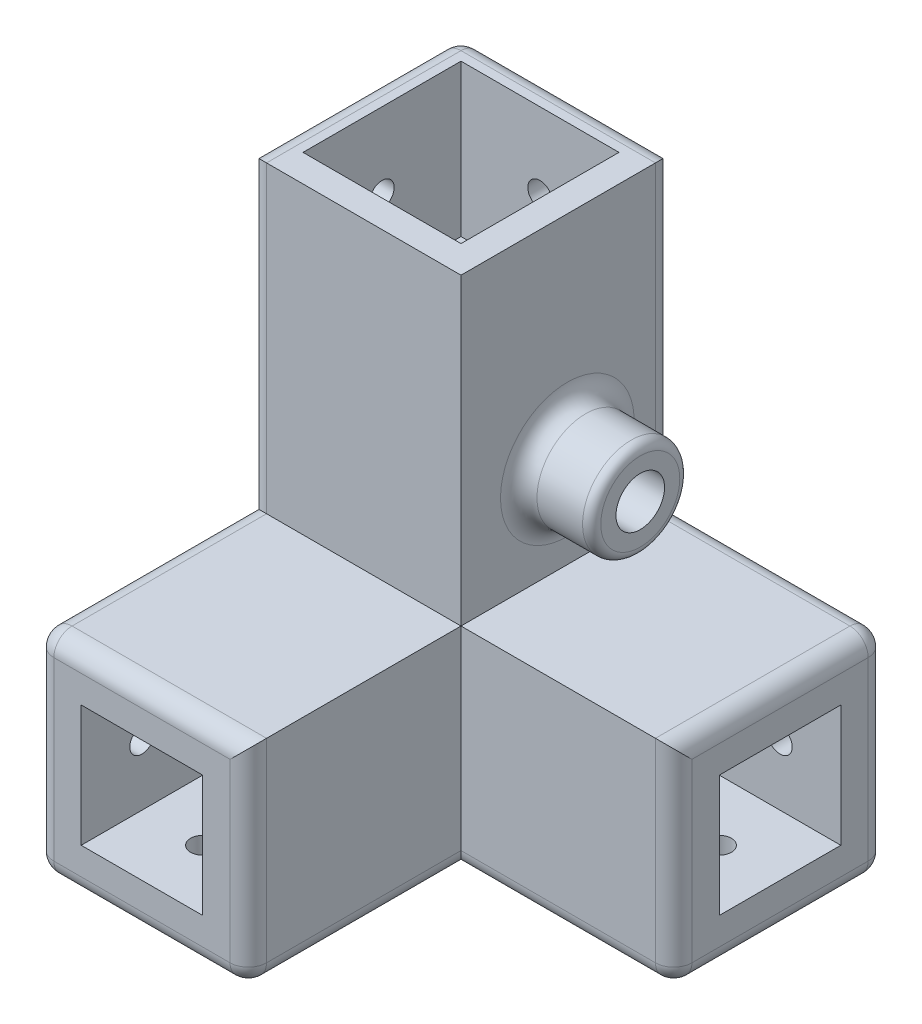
from build123d import *

# Parameters (mm, degrees)
BOSS_EXTRUDE1_DEPTH = 35
SKETCH8_W           = 35
SKETCH8_H           = 35
BOSS_EXTRUDE2_DEPTH = 35
SKETCH9_W           = 20
SKETCH9_H           = 20
CUT_EXTRUDE1_DEPTH  = 20
SKETCH4_W           = 20
SKETCH4_H           = 20
CUT_EXTRUDE2_DEPTH  = 20
SKETCH10_R          = 8
BOSS_EXTRUDE3_DEPTH = 12
SKETCH11_R          = 4
CUT_EXTRUDE3_DEPTH  = 25
SKETCH5_W           = 26
SKETCH5_H           = 26
CUT_EXTRUDE4_DEPTH  = 25
SKETCH12_R          = 2
CUT_EXTRUDE5_DEPTH  = 10
SKETCH13_R          = 2
CUT_EXTRUDE6_DEPTH  = 10
SKETCH14_R          = 2
CUT_EXTRUDE7_DEPTH  = 10
FILLET1_R           = 3
FILLET2_R           = 3
FILLET3_R           = 1.5


with BuildPart() as part:
    # Sketch1 → Boss-Extrude1 (new body)
    with BuildSketch(Plane.XY):
        Polygon((0, 85), (0, 0), (70, 0), (70, 35), (35, 35), (35, 85), align=None)
    extrude(amount=BOSS_EXTRUDE1_DEPTH)

    # Sketch8 → Boss-Extrude2 (add)
    with BuildSketch(Plane.XY.offset(35)):
        with Locations((17.5, 17.5)):
            Rectangle(SKETCH8_W, SKETCH8_H)
    extrude(amount=BOSS_EXTRUDE2_DEPTH)

    # Sketch9 → Cut-Extrude1 (cut)
    with BuildSketch(Plane.XY.offset(70)):
        with Locations((17.5, 17.5)):
            Rectangle(SKETCH9_W, SKETCH9_H)
    extrude(amount=-CUT_EXTRUDE1_DEPTH, mode=Mode.SUBTRACT)

    # Sketch4 → Cut-Extrude2 (cut)
    with BuildSketch(Plane(origin=(70, 0, 0), x_dir=(0, 0, -1), z_dir=(1, 0, 0))):
        with Locations((-17.5, 17.5)):
            Rectangle(SKETCH4_W, SKETCH4_H)
    extrude(amount=-CUT_EXTRUDE2_DEPTH, mode=Mode.SUBTRACT)

    # Sketch10 → Boss-Extrude3 (add)
    with BuildSketch(Plane(origin=(35, 0, 0), x_dir=(0, 0, -1), z_dir=(1, 0, 0))):
        with Locations(Location((-17.5, 50, 0), (0, 0, 180))):
            Circle(SKETCH10_R)
    extrude(amount=BOSS_EXTRUDE3_DEPTH)

    # Sketch11 → Cut-Extrude3 (cut)
    with BuildSketch(Plane(origin=(47, 0, 0), x_dir=(0, 0, -1), z_dir=(1, 0, 0))):
        with Locations((-17.5, 50)):
            Circle(SKETCH11_R)
    extrude(amount=-CUT_EXTRUDE3_DEPTH, mode=Mode.SUBTRACT)

    # Sketch5 → Cut-Extrude4 (cut)
    with BuildSketch(Plane(origin=(0, 85, 0), x_dir=(1, 0, 0), z_dir=(0, 1, 0))):
        with Locations((17.5, -17.5)):
            Rectangle(SKETCH5_W, SKETCH5_H)
    extrude(amount=-CUT_EXTRUDE4_DEPTH, mode=Mode.SUBTRACT)

    # Sketch12 → Cut-Extrude5 (cut)
    with BuildSketch(Plane.ZY):
        with Locations(Location((17.5, 72.5, 0), (0, 0, 270))):
            Circle(SKETCH12_R)
        with Locations(Location((60, 17.5, 0), (0, 0, 270))):
            Circle(SKETCH12_R)
    extrude(amount=-CUT_EXTRUDE5_DEPTH, mode=Mode.SUBTRACT)

    # Sketch13 → Cut-Extrude6 (cut)
    with BuildSketch(Plane(origin=(0, 0, 0), x_dir=(-1, 0, 0), z_dir=(0, 0, -1))):
        with Locations((-17.5, 72.5)):
            Circle(SKETCH13_R)
        with Locations((-60, 17.5)):
            Circle(SKETCH13_R)
    extrude(amount=-CUT_EXTRUDE6_DEPTH, mode=Mode.SUBTRACT)

    # Sketch14 → Cut-Extrude7 (cut)
    with BuildSketch(Plane.XZ):
        with Locations(Location((17.5, 60, 0), (0, 0, 270))):
            Circle(SKETCH14_R)
        with Locations(Location((60, 17.5, 0), (0, 0, 270))):
            Circle(SKETCH14_R)
    extrude(amount=-CUT_EXTRUDE7_DEPTH, mode=Mode.SUBTRACT)

    # Fillet1
    fillet1_edges = [part.edges().sort_by_distance(p)[0] for p in [
        (70, 35, 17.5),
        (70, 0, 17.5),
        (0, 0, 35),
        (0, 85, 17.5),
        (70, 17.5, 35),
        (52.5, 0, 35),
        (0, 35, 52.5),
        (35, 0, 52.5),
        (0, 17.5, 70),
        (17.5, 0, 70),
        (35, 17.5, 70),
        (17.5, 35, 70),
        (35, 60, 0),
        (52.5, 35, 0),
        (70, 17.5, 0),
        (35, 0, 0),
        (0, 42.5, 0),
        (17.5, 85, 0),
        (0, 60, 35),
    ]]
    fillet(fillet1_edges, radius=FILLET1_R)

    # Fillet2
    fillet2_edges = [part.edges().sort_by_distance(p)[0] for p in [
        (35, 50, 9.5),
    ]]
    fillet(fillet2_edges, radius=FILLET2_R)

    # Fillet3
    fillet3_edges = [part.edges().sort_by_distance(p)[0] for p in [
        (47, 50, 9.5),
    ]]
    fillet(fillet3_edges, radius=FILLET3_R)


solid = part.part
